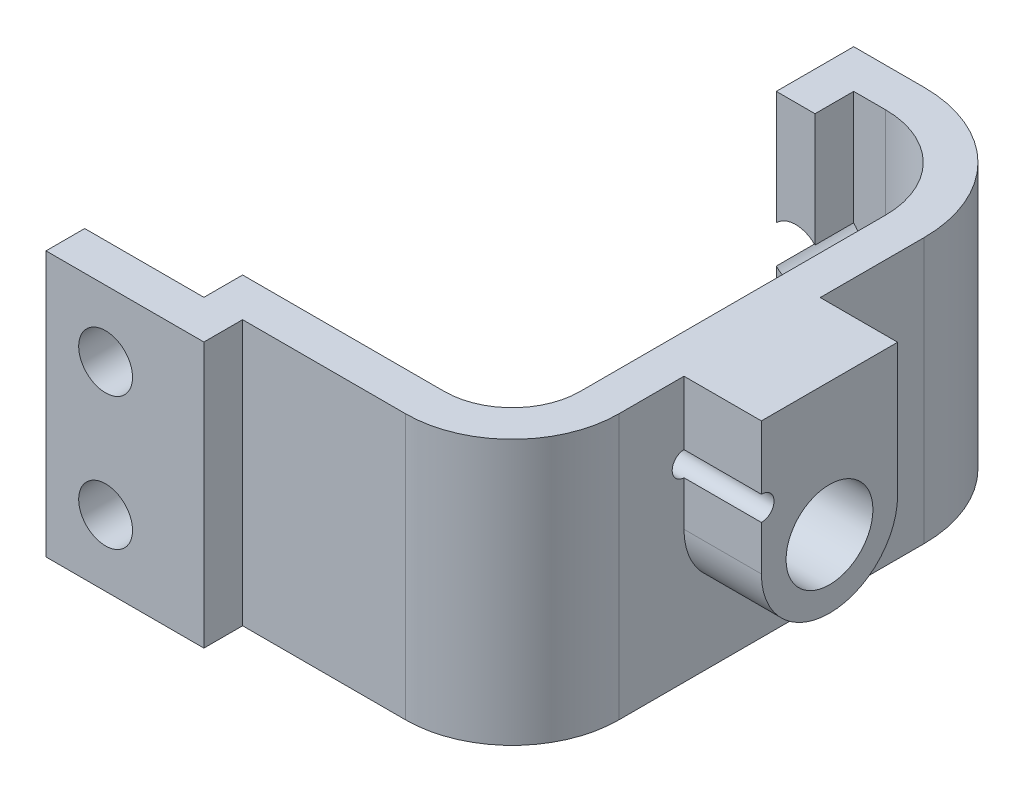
from build123d import *

# Parameters (mm, degrees)
BOSS_EXTRUDE1_DEPTH = 21.75
CUT_EXTRUDE1_REACH  = 62.665
SKETCH2_R           = 0.999998
BOSS_EXTRUDE2_START = 6.35
SKETCH4_R           = 3.5625
BOSS_EXTRUDE2_DEPTH = 6.35
CUT_EXTRUDE2_REACH  = 62.665
SKETCH4_3_R         = 3.5625
SKETCH7_R           = 2.2098
CUT_EXTRUDE3_DEPTH  = 61.338615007
SKETCH9_R           = 2.2098
CUT_EXTRUDE5_DEPTH  = 63.553979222


with BuildPart() as part:
    # Sketch1 → Boss-Extrude1 (new body)
    with BuildSketch(Plane(origin=(0, 0, 0), x_dir=(1, 0, 0), z_dir=(0, 1, 0))):
        with BuildLine():
            Line((28.7253, 8.739808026), (28.7253, 33.787820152))
            ThreePointArc((28.7253, 33.787820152), (26.528897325, 39.090405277), (21.2263122, 41.286807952))
            Line((21.2263122, 41.286807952), (18.625420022, 41.286807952))
            Line((18.625420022, 41.286807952), (18.625420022, 38.111807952))
            Line((18.625420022, 38.111807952), (15.450420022, 38.111807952))
            Line((15.450420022, 38.111807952), (15.450420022, 44.461807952))
            Line((15.450420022, 44.461807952), (21.2263122, 44.461807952))
            ThreePointArc((21.2263122, 44.461807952), (28.773961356, 41.335469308), (31.9003, 33.787820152))
            Line((31.9003, 33.787820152), (31.9003, 8.739808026))
            ThreePointArc((31.9003, 8.739808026), (29.340469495, 2.559830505), (23.160491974, 0))
            Line((23.160491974, 0), (9.779, 0))
            Line((9.779, 0), (9.779, -3.175))
            Line((9.779, -3.175), (-3.175, -3.175))
            Line((-3.175, -3.175), (-3.175, 0))
            Line((-3.175, 0), (0, 0))
            Line((0, 0), (6.604, 0))
            Line((6.604, 0), (6.604, 3.175))
            Line((6.604, 3.175), (23.160491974, 3.175))
            ThreePointArc((23.160491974, 3.175), (27.095405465, 4.804894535), (28.7253, 8.739808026))
        make_face()
    extrude(amount=BOSS_EXTRUDE1_DEPTH)

    # Sketch2 → Cut-Extrude1 (cut, up to next)
    with BuildSketch(Plane(origin=(31.9003, 0, 0), x_dir=(0, 0, -1), z_dir=(1, 0, 0)), mode=Mode.PRIVATE) as cut_extrude1_sk1:
        with Locations((25.230136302, 6.21478983)):
            Circle(SKETCH2_R)
    cut_extrude1_tool1 = extrude(cut_extrude1_sk1.sketch, amount=-CUT_EXTRUDE1_REACH, mode=Mode.PRIVATE) & part.part
    # Sketch2 → Cut-Extrude1 (cut, up to next)
    with BuildSketch(Plane(origin=(31.9003, 0, 0), x_dir=(0, 0, -1), z_dir=(1, 0, 0)), mode=Mode.PRIVATE) as cut_extrude1_sk2:
        with Locations((14.122491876, 15.53521017)):
            Circle(SKETCH2_R)
    cut_extrude1_tool2 = extrude(cut_extrude1_sk2.sketch, amount=-CUT_EXTRUDE1_REACH, mode=Mode.PRIVATE) & part.part
    add(cut_extrude1_tool1.solids().sort_by_distance((31.9003, 6.21479, -25.230136))[0], mode=Mode.SUBTRACT)
    add(cut_extrude1_tool2.solids().sort_by_distance((31.9003, 15.53521, -14.122492))[0], mode=Mode.SUBTRACT)

    # Sketch4 → Boss-Extrude2 (add)
    with BuildSketch(Plane(origin=(31.9003, 0, 0), x_dir=(0, 0, -1), z_dir=(1, 0, 0)).offset(BOSS_EXTRUDE2_START)):
        with BuildLine():
            Line((14.088314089, 10.875), (14.088314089, 14.535796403))
            ThreePointArc((14.088314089, 14.535796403), (15.122489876, 15.53521017), (14.088314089, 16.534623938))
            Line((14.088314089, 16.534623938), (14.088314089, 21.75))
            Line((14.088314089, 21.75), (25.264314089, 21.75))
            Line((25.264314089, 21.75), (25.264314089, 10.875))
            ThreePointArc((25.264314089, 10.875), (19.676314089, 5.287), (14.088314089, 10.875))
        make_face()
        with Locations((19.676314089, 10.875)):
            Circle(SKETCH4_R, mode=Mode.SUBTRACT)
    extrude(amount=-BOSS_EXTRUDE2_DEPTH)

    # Sketch4_3 → Cut-Extrude2 (cut, up to next)
    with BuildSketch(Plane(origin=(31.9003, 0, 0), x_dir=(0, 0, -1), z_dir=(1, 0, 0)), mode=Mode.PRIVATE) as cut_extrude2_sk1:
        with Locations(Location((19.676314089, 10.875, 0), (0, 0, 180))):
            Circle(SKETCH4_3_R)
    cut_extrude2_tool1 = extrude(cut_extrude2_sk1.sketch, amount=-CUT_EXTRUDE2_REACH, mode=Mode.PRIVATE) & part.part
    add(cut_extrude2_tool1.solids().sort_by_distance((31.9003, 10.875, -19.676314))[0], mode=Mode.SUBTRACT)

    # Sketch7 → Cut-Extrude3 (cut, through all)
    with BuildSketch(Plane.XY.offset(-38.111807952)):
        with Locations((17.037920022, 10.875)):
            Circle(SKETCH7_R)
    extrude(amount=-CUT_EXTRUDE3_DEPTH, mode=Mode.SUBTRACT)

    # Sketch9 → Cut-Extrude5 (cut, through all)
    with BuildSketch(Plane(origin=(0, 0, 0), x_dir=(-1, 0, 0), z_dir=(0, 0, -1))):
        with Locations((-1.7145, 5.4375)):
            Circle(SKETCH9_R)
        with Locations((-1.7145, 16.3125)):
            Circle(SKETCH9_R)
    extrude(amount=-CUT_EXTRUDE5_DEPTH, mode=Mode.SUBTRACT)


solid = part.part
